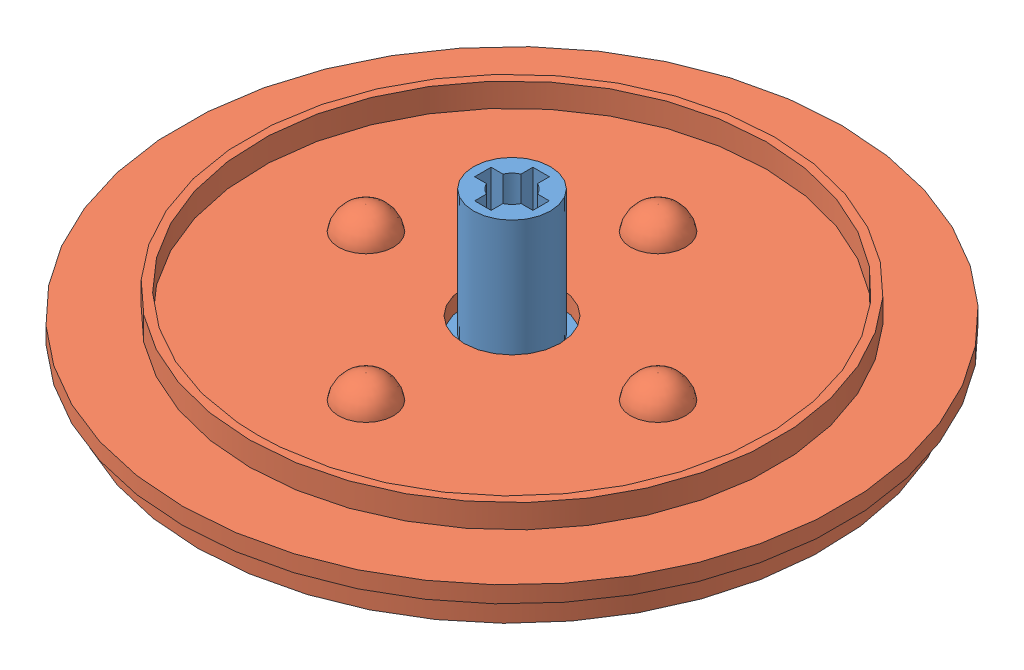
SolidWorks assembly Assem1.sldasm, configuration Default (file format 14000). Lengths in mm.
Overall size (168.9 195.66 120).
2 component instances, 2 part files, 2 mates.
Components (placement in the parent):
- chopper motor adapter-2: chopper motor adapter.SLDPRT [Default] at (547.9662 557.6529 609.4026) x (1 0 0) z (0 0 -1) size (158.03 195.66 43.5)
- chopper jar base adapter-2: chopper jar base adapter.SLDPRT [Default] at (547.9662 557.6529 609.4026) size (120 14.3 120)
Mates (geometry in assembly coordinates):
- Coincident1: coincident: plane of chopper motor adapter-2 through (547.9662 557.6529 609.4026) normal (0 1 0); plane of chopper jar base adapter-2 through (547.9662 557.6529 609.4026) normal (0 -1 0)
- Concentric1: concentric: cylinder of chopper motor adapter-2 through (547.9662 580.6529 609.4026) axis (0 -1 0) radius 7; cylinder of chopper jar base adapter-2 through (547.9662 560.6529 609.4026) axis (0 -1 0) radius 8.75
